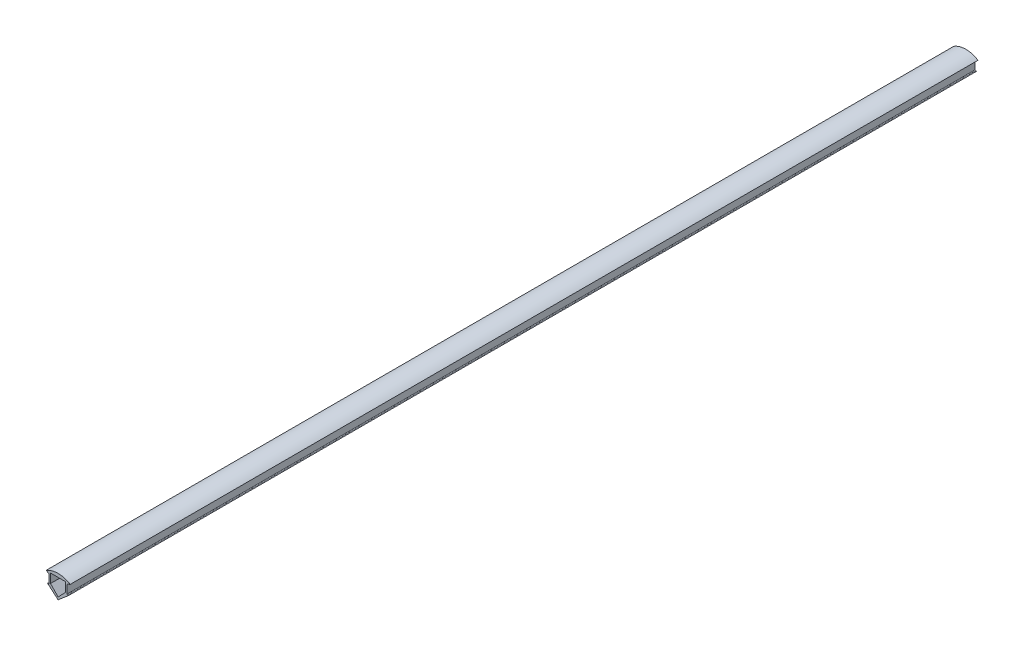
from build123d import *

# Parameters (mm, degrees)
EXTRUDE_1_DEPTH = 150


with BuildPart() as part:
    # Sketch 1 → Extrude 1 (new, symmetric)
    with BuildSketch(Plane.XY):
        with BuildLine():
            Line((0, -3), (-3.5, 0))
            Line((-3.5, 0), (-3.2, 0))
            ThreePointArc((-3.2, 0), (-3.058578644, 0.058578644), (-3, 0.2))
            Line((-3, 0.2), (-3, 2.867696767))
            ThreePointArc((-3, 2.867696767), (-3.033194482, 2.978041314), (-3.12175919, 3.05175756))
            Line((-3.12175919, 3.05175756), (-4, 3.425081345))
            ThreePointArc((-4, 3.425081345), (0, 4.568465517), (4, 3.425081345))
            Line((4, 3.425081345), (3.12175919, 3.05175756))
            ThreePointArc((3.12175919, 3.05175756), (3.033194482, 2.978041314), (3, 2.867696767))
            Line((3, 2.867696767), (3, 0.2))
            ThreePointArc((3, 0.2), (3.058578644, 0.058578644), (3.2, 0))
            Line((3.2, 0), (3.5, 0))
            Line((3.5, 0), (0, -3))
        make_face()
        Polygon((-2.5, 0.425081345), (0, -2.200372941), (2.5, 0.425081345), (2.5, 3.425081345), (-2.5, 3.425081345), align=None, mode=Mode.SUBTRACT)
    extrude(amount=EXTRUDE_1_DEPTH, both=True)


solid = part.part
